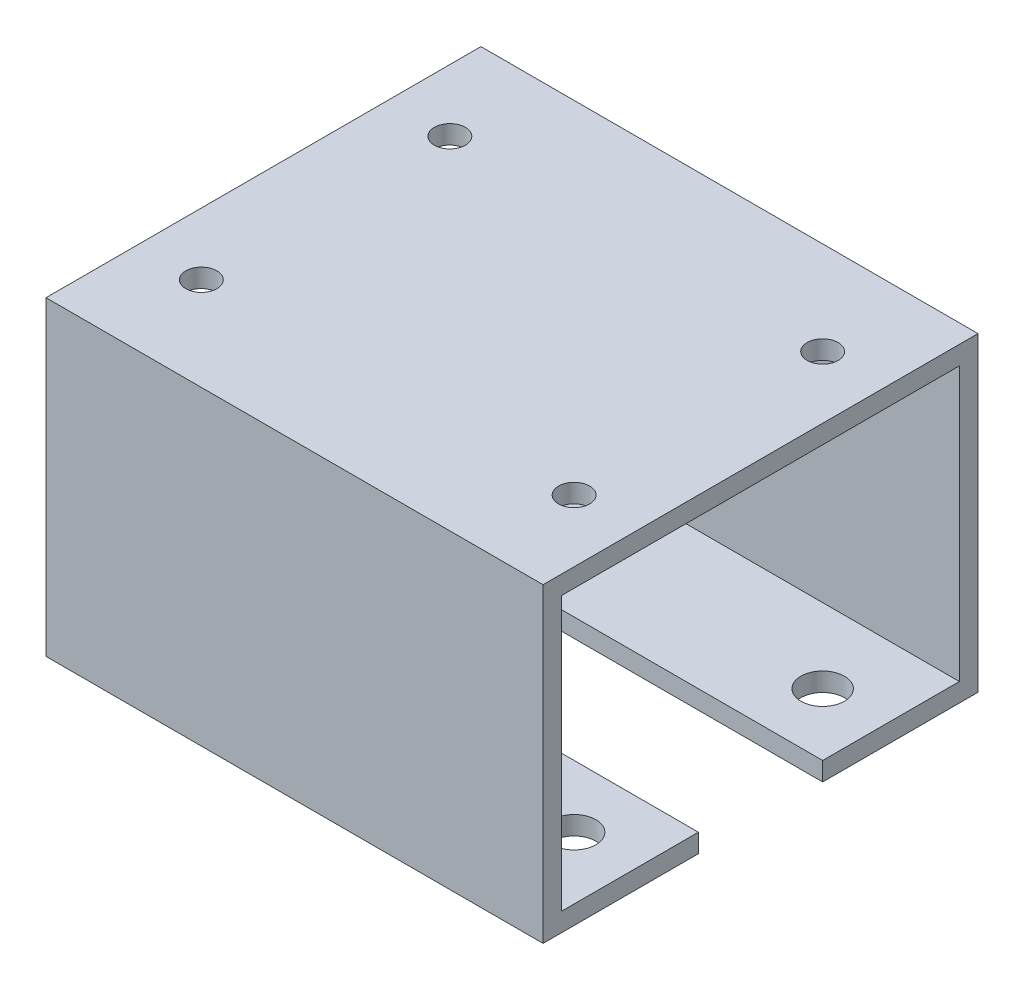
ISO-10303-21;
HEADER;
FILE_DESCRIPTION(('STEP AP214'),'2;1');
FILE_NAME('part.step','',(''),(''),'','','');
FILE_SCHEMA(('AUTOMOTIVE_DESIGN { 1 0 10303 214 1 1 1 1 }'));
ENDSEC;
DATA;
#1=APPLICATION_CONTEXT('core data for automotive mechanical design processes');
#2=APPLICATION_PROTOCOL_DEFINITION('international standard','automotive_design',2000,#1);
#3=PRODUCT_CONTEXT('',#1,'mechanical');
#4=PRODUCT('Part','Part','',(#3));
#5=PRODUCT_RELATED_PRODUCT_CATEGORY('part','',(#4));
#6=PRODUCT_DEFINITION_FORMATION('','',#4);
#7=PRODUCT_DEFINITION_CONTEXT('part definition',#1,'design');
#8=PRODUCT_DEFINITION('design','',#6,#7);
#9=PRODUCT_DEFINITION_SHAPE('','',#8);
#10=(LENGTH_UNIT() NAMED_UNIT(*) SI_UNIT(.MILLI.,.METRE.));
#11=(NAMED_UNIT(*) PLANE_ANGLE_UNIT() SI_UNIT($,.RADIAN.));
#12=(NAMED_UNIT(*) SI_UNIT($,.STERADIAN.) SOLID_ANGLE_UNIT());
#13=UNCERTAINTY_MEASURE_WITH_UNIT(LENGTH_MEASURE(1.E-05),#10,'distance_accuracy_value','');
#14=(GEOMETRIC_REPRESENTATION_CONTEXT(3) GLOBAL_UNCERTAINTY_ASSIGNED_CONTEXT((#13)) GLOBAL_UNIT_ASSIGNED_CONTEXT((#10,
#11,#12)) REPRESENTATION_CONTEXT('',''));
#15=CARTESIAN_POINT('',(0.,0.,0.));
#16=DIRECTION('',(0.,0.,1.));
#17=DIRECTION('',(1.,0.,0.));
#18=AXIS2_PLACEMENT_3D('',#15,#16,#17);
#19=CARTESIAN_POINT('',(-40.,156.301458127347,-35.));
#20=DIRECTION('',(1.,0.,0.));
#21=DIRECTION('',(0.,0.,-1.));
#22=AXIS2_PLACEMENT_3D('',#19,#20,#21);
#23=PLANE('',#22);
#24=DIRECTION('',(0.,-1.,0.));
#25=VECTOR('',#24,1.);
#26=CARTESIAN_POINT('',(-40.,50.001,10.));
#27=LINE('',#26,#25);
#28=CARTESIAN_POINT('',(-40.,3.,9.99999999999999));
#29=VERTEX_POINT('',#28);
#30=CARTESIAN_POINT('',(-40.,0.,10.));
#31=VERTEX_POINT('',#30);
#32=EDGE_CURVE('E55',#29,#31,#27,.T.);
#33=ORIENTED_EDGE('',*,*,#32,.T.);
#34=DIRECTION('',(0.,0.,1.));
#35=VECTOR('',#34,1.);
#36=CARTESIAN_POINT('',(-40.,0.,-35.));
#37=LINE('',#36,#35);
#38=CARTESIAN_POINT('',(-40.,0.,35.));
#39=VERTEX_POINT('',#38);
#40=EDGE_CURVE('E177',#31,#39,#37,.T.);
#41=ORIENTED_EDGE('',*,*,#40,.T.);
#42=DIRECTION('',(0.,-1.,0.));
#43=VECTOR('',#42,1.);
#44=CARTESIAN_POINT('',(-40.,156.301458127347,35.));
#45=LINE('',#44,#43);
#46=CARTESIAN_POINT('',(-40.,50.,35.));
#47=VERTEX_POINT('',#46);
#48=EDGE_CURVE('E176',#47,#39,#45,.T.);
#49=ORIENTED_EDGE('',*,*,#48,.F.);
#50=DIRECTION('',(0.,0.,1.));
#51=VECTOR('',#50,1.);
#52=CARTESIAN_POINT('',(-40.,50.,-35.));
#53=LINE('',#52,#51);
#54=CARTESIAN_POINT('',(-40.,50.,-35.));
#55=VERTEX_POINT('',#54);
#56=EDGE_CURVE('E181',#55,#47,#53,.T.);
#57=ORIENTED_EDGE('',*,*,#56,.F.);
#58=DIRECTION('',(0.,-1.,0.));
#59=VECTOR('',#58,1.);
#60=CARTESIAN_POINT('',(-40.,156.301458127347,-35.));
#61=LINE('',#60,#59);
#62=CARTESIAN_POINT('',(-40.,0.,-35.));
#63=VERTEX_POINT('',#62);
#64=EDGE_CURVE('E34',#55,#63,#61,.T.);
#65=ORIENTED_EDGE('',*,*,#64,.T.);
#66=CARTESIAN_POINT('',(-40.,0.,-10.));
#67=VERTEX_POINT('',#66);
#68=EDGE_CURVE('E134',#63,#67,#37,.T.);
#69=ORIENTED_EDGE('',*,*,#68,.T.);
#70=DIRECTION('',(0.,-1.,0.));
#71=VECTOR('',#70,1.);
#72=CARTESIAN_POINT('',(-40.,50.001,-10.));
#73=LINE('',#72,#71);
#74=CARTESIAN_POINT('',(-40.,3.,-10.));
#75=VERTEX_POINT('',#74);
#76=EDGE_CURVE('E121',#75,#67,#73,.T.);
#77=ORIENTED_EDGE('',*,*,#76,.F.);
#78=DIRECTION('',(0.,0.,1.));
#79=VECTOR('',#78,1.);
#80=CARTESIAN_POINT('',(-40.,3.,-35.));
#81=LINE('',#80,#79);
#82=CARTESIAN_POINT('',(-40.,3.,-32.));
#83=VERTEX_POINT('',#82);
#84=EDGE_CURVE('E132',#83,#75,#81,.T.);
#85=ORIENTED_EDGE('',*,*,#84,.F.);
#86=DIRECTION('',(0.,-1.,0.));
#87=VECTOR('',#86,1.);
#88=CARTESIAN_POINT('',(-40.,156.301458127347,-32.));
#89=LINE('',#88,#87);
#90=CARTESIAN_POINT('',(-40.,47.,-32.));
#91=VERTEX_POINT('',#90);
#92=EDGE_CURVE('E126',#91,#83,#89,.T.);
#93=ORIENTED_EDGE('',*,*,#92,.F.);
#94=DIRECTION('',(0.,0.,1.));
#95=VECTOR('',#94,1.);
#96=CARTESIAN_POINT('',(-40.,47.,-35.));
#97=LINE('',#96,#95);
#98=CARTESIAN_POINT('',(-40.,47.,32.));
#99=VERTEX_POINT('',#98);
#100=EDGE_CURVE('E210',#91,#99,#97,.T.);
#101=ORIENTED_EDGE('',*,*,#100,.T.);
#102=DIRECTION('',(0.,-1.,0.));
#103=VECTOR('',#102,1.);
#104=CARTESIAN_POINT('',(-40.,156.301458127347,32.));
#105=LINE('',#104,#103);
#106=CARTESIAN_POINT('',(-40.,3.,32.));
#107=VERTEX_POINT('',#106);
#108=EDGE_CURVE('E141',#99,#107,#105,.T.);
#109=ORIENTED_EDGE('',*,*,#108,.T.);
#110=EDGE_CURVE('E142',#29,#107,#81,.T.);
#111=ORIENTED_EDGE('',*,*,#110,.F.);
#112=EDGE_LOOP('',(#33,#41,#49,#57,#65,#69,#77,#85,#93,#101,#109,#111));
#113=FACE_BOUND('',#112,.T.);
#114=ADVANCED_FACE('F30',(#113),#23,.F.);
#115=CARTESIAN_POINT('',(40.,156.301458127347,-35.));
#116=DIRECTION('',(-1.,0.,0.));
#117=DIRECTION('',(0.,0.,1.));
#118=AXIS2_PLACEMENT_3D('',#115,#116,#117);
#119=PLANE('',#118);
#120=DIRECTION('',(0.,-1.,0.));
#121=VECTOR('',#120,1.);
#122=CARTESIAN_POINT('',(40.,50.001,9.99999999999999));
#123=LINE('',#122,#121);
#124=CARTESIAN_POINT('',(40.,3.,9.99999999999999));
#125=VERTEX_POINT('',#124);
#126=CARTESIAN_POINT('',(40.,0.,9.99999999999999));
#127=VERTEX_POINT('',#126);
#128=EDGE_CURVE('E205',#125,#127,#123,.T.);
#129=ORIENTED_EDGE('',*,*,#128,.F.);
#130=DIRECTION('',(0.,0.,-1.));
#131=VECTOR('',#130,1.);
#132=CARTESIAN_POINT('',(40.,3.,-35.));
#133=LINE('',#132,#131);
#134=CARTESIAN_POINT('',(40.,3.,32.));
#135=VERTEX_POINT('',#134);
#136=EDGE_CURVE('E153',#135,#125,#133,.T.);
#137=ORIENTED_EDGE('',*,*,#136,.F.);
#138=DIRECTION('',(0.,-1.,0.));
#139=VECTOR('',#138,1.);
#140=CARTESIAN_POINT('',(40.,156.301458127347,32.));
#141=LINE('',#140,#139);
#142=CARTESIAN_POINT('',(40.,47.,32.));
#143=VERTEX_POINT('',#142);
#144=EDGE_CURVE('E150',#143,#135,#141,.T.);
#145=ORIENTED_EDGE('',*,*,#144,.F.);
#146=DIRECTION('',(0.,0.,-1.));
#147=VECTOR('',#146,1.);
#148=CARTESIAN_POINT('',(40.,47.,-35.));
#149=LINE('',#148,#147);
#150=CARTESIAN_POINT('',(40.,47.,-32.));
#151=VERTEX_POINT('',#150);
#152=EDGE_CURVE('E159',#143,#151,#149,.T.);
#153=ORIENTED_EDGE('',*,*,#152,.T.);
#154=DIRECTION('',(0.,-1.,0.));
#155=VECTOR('',#154,1.);
#156=CARTESIAN_POINT('',(40.,156.301458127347,-32.));
#157=LINE('',#156,#155);
#158=CARTESIAN_POINT('',(40.,3.,-32.));
#159=VERTEX_POINT('',#158);
#160=EDGE_CURVE('E156',#151,#159,#157,.T.);
#161=ORIENTED_EDGE('',*,*,#160,.T.);
#162=CARTESIAN_POINT('',(40.,3.,-10.));
#163=VERTEX_POINT('',#162);
#164=EDGE_CURVE('E152',#163,#159,#133,.T.);
#165=ORIENTED_EDGE('',*,*,#164,.F.);
#166=DIRECTION('',(0.,-1.,0.));
#167=VECTOR('',#166,1.);
#168=CARTESIAN_POINT('',(40.,50.001,-10.));
#169=LINE('',#168,#167);
#170=CARTESIAN_POINT('',(40.,0.,-10.));
#171=VERTEX_POINT('',#170);
#172=EDGE_CURVE('E47',#163,#171,#169,.T.);
#173=ORIENTED_EDGE('',*,*,#172,.T.);
#174=DIRECTION('',(0.,0.,-1.));
#175=VECTOR('',#174,1.);
#176=CARTESIAN_POINT('',(40.,0.,-35.));
#177=LINE('',#176,#175);
#178=CARTESIAN_POINT('',(40.,0.,-35.));
#179=VERTEX_POINT('',#178);
#180=EDGE_CURVE('E171',#171,#179,#177,.T.);
#181=ORIENTED_EDGE('',*,*,#180,.T.);
#182=DIRECTION('',(0.,-1.,0.));
#183=VECTOR('',#182,1.);
#184=CARTESIAN_POINT('',(40.,156.301458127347,-35.));
#185=LINE('',#184,#183);
#186=CARTESIAN_POINT('',(40.,50.,-35.));
#187=VERTEX_POINT('',#186);
#188=EDGE_CURVE('E167',#187,#179,#185,.T.);
#189=ORIENTED_EDGE('',*,*,#188,.F.);
#190=DIRECTION('',(0.,0.,-1.));
#191=VECTOR('',#190,1.);
#192=CARTESIAN_POINT('',(40.,50.,-35.));
#193=LINE('',#192,#191);
#194=CARTESIAN_POINT('',(40.,50.,35.));
#195=VERTEX_POINT('',#194);
#196=EDGE_CURVE('E11',#195,#187,#193,.T.);
#197=ORIENTED_EDGE('',*,*,#196,.F.);
#198=DIRECTION('',(0.,-1.,0.));
#199=VECTOR('',#198,1.);
#200=CARTESIAN_POINT('',(40.,156.301458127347,35.));
#201=LINE('',#200,#199);
#202=CARTESIAN_POINT('',(40.,0.,35.));
#203=VERTEX_POINT('',#202);
#204=EDGE_CURVE('E175',#195,#203,#201,.T.);
#205=ORIENTED_EDGE('',*,*,#204,.T.);
#206=EDGE_CURVE('E168',#203,#127,#177,.T.);
#207=ORIENTED_EDGE('',*,*,#206,.T.);
#208=EDGE_LOOP('',(#129,#137,#145,#153,#161,#165,#173,#181,#189,#197,#205,#207));
#209=FACE_BOUND('',#208,.T.);
#210=ADVANCED_FACE('F225',(#209),#119,.F.);
#211=CARTESIAN_POINT('',(-40.,0.,35.));
#212=DIRECTION('',(0.,1.,0.));
#213=DIRECTION('',(0.,0.,1.));
#214=AXIS2_PLACEMENT_3D('',#211,#212,#213);
#215=PLANE('',#214);
#216=CARTESIAN_POINT('',(-30.,0.,20.));
#217=DIRECTION('',(0.,1.,0.));
#218=DIRECTION('',(0.,0.,1.));
#219=AXIS2_PLACEMENT_3D('',#216,#217,#218);
#220=CIRCLE('',#219,3.5);
#221=CARTESIAN_POINT('',(-30.,0.,23.5));
#222=VERTEX_POINT('',#221);
#223=EDGE_CURVE('E353',#222,#222,#220,.T.);
#224=ORIENTED_EDGE('',*,*,#223,.T.);
#225=EDGE_LOOP('',(#224));
#226=FACE_BOUND('',#225,.T.);
#227=CARTESIAN_POINT('',(30.,0.,20.));
#228=DIRECTION('',(0.,1.,0.));
#229=DIRECTION('',(0.,0.,1.));
#230=AXIS2_PLACEMENT_3D('',#227,#228,#229);
#231=CIRCLE('',#230,3.5);
#232=CARTESIAN_POINT('',(30.,0.,23.5));
#233=VERTEX_POINT('',#232);
#234=EDGE_CURVE('E359',#233,#233,#231,.T.);
#235=ORIENTED_EDGE('',*,*,#234,.T.);
#236=EDGE_LOOP('',(#235));
#237=FACE_BOUND('',#236,.T.);
#238=DIRECTION('',(1.,0.,0.));
#239=VECTOR('',#238,1.);
#240=CARTESIAN_POINT('',(-40.,0.,10.));
#241=LINE('',#240,#239);
#242=EDGE_CURVE('E197',#31,#127,#241,.T.);
#243=ORIENTED_EDGE('',*,*,#242,.T.);
#244=ORIENTED_EDGE('',*,*,#206,.F.);
#245=DIRECTION('',(1.,0.,0.));
#246=VECTOR('',#245,1.);
#247=CARTESIAN_POINT('',(-40.,0.,35.));
#248=LINE('',#247,#246);
#249=EDGE_CURVE('E172',#39,#203,#248,.T.);
#250=ORIENTED_EDGE('',*,*,#249,.F.);
#251=ORIENTED_EDGE('',*,*,#40,.F.);
#252=EDGE_LOOP('',(#243,#244,#250,#251));
#253=FACE_BOUND('',#252,.T.);
#254=ADVANCED_FACE('F237',(#226,#237,#253),#215,.F.);
#255=CARTESIAN_POINT('',(30.,0.,-20.));
#256=DIRECTION('',(0.,1.,0.));
#257=DIRECTION('',(0.,0.,1.));
#258=AXIS2_PLACEMENT_3D('',#255,#256,#257);
#259=CIRCLE('',#258,3.5);
#260=CARTESIAN_POINT('',(30.,0.,-16.5));
#261=VERTEX_POINT('',#260);
#262=EDGE_CURVE('E341',#261,#261,#259,.T.);
#263=ORIENTED_EDGE('',*,*,#262,.T.);
#264=EDGE_LOOP('',(#263));
#265=FACE_BOUND('',#264,.T.);
#266=CARTESIAN_POINT('',(-30.,0.,-20.));
#267=DIRECTION('',(0.,1.,0.));
#268=DIRECTION('',(0.,0.,1.));
#269=AXIS2_PLACEMENT_3D('',#266,#267,#268);
#270=CIRCLE('',#269,3.5);
#271=CARTESIAN_POINT('',(-30.,0.,-16.5));
#272=VERTEX_POINT('',#271);
#273=EDGE_CURVE('E347',#272,#272,#270,.T.);
#274=ORIENTED_EDGE('',*,*,#273,.T.);
#275=EDGE_LOOP('',(#274));
#276=FACE_BOUND('',#275,.T.);
#277=DIRECTION('',(-1.,0.,0.));
#278=VECTOR('',#277,1.);
#279=CARTESIAN_POINT('',(-40.,0.,-10.));
#280=LINE('',#279,#278);
#281=EDGE_CURVE('E135',#171,#67,#280,.T.);
#282=ORIENTED_EDGE('',*,*,#281,.T.);
#283=ORIENTED_EDGE('',*,*,#68,.F.);
#284=DIRECTION('',(-1.,0.,0.));
#285=VECTOR('',#284,1.);
#286=CARTESIAN_POINT('',(-40.,0.,-35.));
#287=LINE('',#286,#285);
#288=EDGE_CURVE('E163',#179,#63,#287,.T.);
#289=ORIENTED_EDGE('',*,*,#288,.F.);
#290=ORIENTED_EDGE('',*,*,#180,.F.);
#291=EDGE_LOOP('',(#282,#283,#289,#290));
#292=FACE_BOUND('',#291,.T.);
#293=ADVANCED_FACE('F196',(#265,#276,#292),#215,.F.);
#294=CARTESIAN_POINT('',(-40.,3.,35.));
#295=DIRECTION('',(0.,1.,0.));
#296=DIRECTION('',(0.,0.,1.));
#297=AXIS2_PLACEMENT_3D('',#294,#295,#296);
#298=PLANE('',#297);
#299=CARTESIAN_POINT('',(-30.,3.,20.));
#300=DIRECTION('',(0.,1.,0.));
#301=DIRECTION('',(0.,0.,1.));
#302=AXIS2_PLACEMENT_3D('',#299,#300,#301);
#303=CIRCLE('',#302,3.5);
#304=CARTESIAN_POINT('',(-30.,3.,23.5));
#305=VERTEX_POINT('',#304);
#306=EDGE_CURVE('E350',#305,#305,#303,.T.);
#307=ORIENTED_EDGE('',*,*,#306,.F.);
#308=EDGE_LOOP('',(#307));
#309=FACE_BOUND('',#308,.T.);
#310=CARTESIAN_POINT('',(30.,3.,20.));
#311=DIRECTION('',(0.,1.,0.));
#312=DIRECTION('',(0.,0.,1.));
#313=AXIS2_PLACEMENT_3D('',#310,#311,#312);
#314=CIRCLE('',#313,3.5);
#315=CARTESIAN_POINT('',(30.,3.,23.5));
#316=VERTEX_POINT('',#315);
#317=EDGE_CURVE('E356',#316,#316,#314,.T.);
#318=ORIENTED_EDGE('',*,*,#317,.F.);
#319=EDGE_LOOP('',(#318));
#320=FACE_BOUND('',#319,.T.);
#321=ORIENTED_EDGE('',*,*,#136,.T.);
#322=DIRECTION('',(1.,0.,0.));
#323=VECTOR('',#322,1.);
#324=CARTESIAN_POINT('',(-40.,3.,10.));
#325=LINE('',#324,#323);
#326=EDGE_CURVE('E200',#29,#125,#325,.T.);
#327=ORIENTED_EDGE('',*,*,#326,.F.);
#328=ORIENTED_EDGE('',*,*,#110,.T.);
#329=DIRECTION('',(1.,0.,0.));
#330=VECTOR('',#329,1.);
#331=CARTESIAN_POINT('',(-40.,3.,32.));
#332=LINE('',#331,#330);
#333=EDGE_CURVE('E145',#107,#135,#332,.T.);
#334=ORIENTED_EDGE('',*,*,#333,.T.);
#335=EDGE_LOOP('',(#321,#327,#328,#334));
#336=FACE_BOUND('',#335,.T.);
#337=ADVANCED_FACE('F232',(#309,#320,#336),#298,.T.);
#338=CARTESIAN_POINT('',(30.,3.,-20.));
#339=DIRECTION('',(0.,1.,0.));
#340=DIRECTION('',(0.,0.,1.));
#341=AXIS2_PLACEMENT_3D('',#338,#339,#340);
#342=CIRCLE('',#341,3.5);
#343=CARTESIAN_POINT('',(30.,3.,-16.5));
#344=VERTEX_POINT('',#343);
#345=EDGE_CURVE('E340',#344,#344,#342,.T.);
#346=ORIENTED_EDGE('',*,*,#345,.F.);
#347=EDGE_LOOP('',(#346));
#348=FACE_BOUND('',#347,.T.);
#349=CARTESIAN_POINT('',(-30.,3.,-20.));
#350=DIRECTION('',(0.,1.,0.));
#351=DIRECTION('',(0.,0.,1.));
#352=AXIS2_PLACEMENT_3D('',#349,#350,#351);
#353=CIRCLE('',#352,3.5);
#354=CARTESIAN_POINT('',(-30.,3.,-16.5));
#355=VERTEX_POINT('',#354);
#356=EDGE_CURVE('E344',#355,#355,#353,.T.);
#357=ORIENTED_EDGE('',*,*,#356,.F.);
#358=EDGE_LOOP('',(#357));
#359=FACE_BOUND('',#358,.T.);
#360=ORIENTED_EDGE('',*,*,#84,.T.);
#361=DIRECTION('',(-1.,0.,0.));
#362=VECTOR('',#361,1.);
#363=CARTESIAN_POINT('',(-40.,3.,-10.));
#364=LINE('',#363,#362);
#365=EDGE_CURVE('E118',#163,#75,#364,.T.);
#366=ORIENTED_EDGE('',*,*,#365,.F.);
#367=ORIENTED_EDGE('',*,*,#164,.T.);
#368=DIRECTION('',(-1.,0.,0.));
#369=VECTOR('',#368,1.);
#370=CARTESIAN_POINT('',(-40.,3.,-32.));
#371=LINE('',#370,#369);
#372=EDGE_CURVE('E140',#159,#83,#371,.T.);
#373=ORIENTED_EDGE('',*,*,#372,.T.);
#374=EDGE_LOOP('',(#360,#366,#367,#373));
#375=FACE_BOUND('',#374,.T.);
#376=ADVANCED_FACE('F138',(#348,#359,#375),#298,.T.);
#377=CARTESIAN_POINT('',(-40.,156.301458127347,35.));
#378=DIRECTION('',(0.,0.,-1.));
#379=DIRECTION('',(-1.,0.,0.));
#380=AXIS2_PLACEMENT_3D('',#377,#378,#379);
#381=PLANE('',#380);
#382=DIRECTION('',(1.,0.,0.));
#383=VECTOR('',#382,1.);
#384=CARTESIAN_POINT('',(-40.,50.,35.));
#385=LINE('',#384,#383);
#386=EDGE_CURVE('E39',#47,#195,#385,.T.);
#387=ORIENTED_EDGE('',*,*,#386,.F.);
#388=ORIENTED_EDGE('',*,*,#48,.T.);
#389=ORIENTED_EDGE('',*,*,#249,.T.);
#390=ORIENTED_EDGE('',*,*,#204,.F.);
#391=EDGE_LOOP('',(#387,#388,#389,#390));
#392=FACE_BOUND('',#391,.T.);
#393=ADVANCED_FACE('F244',(#392),#381,.F.);
#394=CARTESIAN_POINT('',(-40.,156.301458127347,-35.));
#395=DIRECTION('',(0.,0.,1.));
#396=DIRECTION('',(1.,0.,0.));
#397=AXIS2_PLACEMENT_3D('',#394,#395,#396);
#398=PLANE('',#397);
#399=DIRECTION('',(-1.,0.,0.));
#400=VECTOR('',#399,1.);
#401=CARTESIAN_POINT('',(-40.,50.,-35.));
#402=LINE('',#401,#400);
#403=EDGE_CURVE('E166',#187,#55,#402,.T.);
#404=ORIENTED_EDGE('',*,*,#403,.F.);
#405=ORIENTED_EDGE('',*,*,#188,.T.);
#406=ORIENTED_EDGE('',*,*,#288,.T.);
#407=ORIENTED_EDGE('',*,*,#64,.F.);
#408=EDGE_LOOP('',(#404,#405,#406,#407));
#409=FACE_BOUND('',#408,.T.);
#410=ADVANCED_FACE('F192',(#409),#398,.F.);
#411=CARTESIAN_POINT('',(0.,50.,0.));
#412=DIRECTION('',(0.,1.,0.));
#413=DIRECTION('',(0.,0.,1.));
#414=AXIS2_PLACEMENT_3D('',#411,#412,#413);
#415=PLANE('',#414);
#416=CARTESIAN_POINT('',(-30.,50.,-20.));
#417=DIRECTION('',(0.,1.,0.));
#418=DIRECTION('',(0.,0.,1.));
#419=AXIS2_PLACEMENT_3D('',#416,#417,#418);
#420=CIRCLE('',#419,2.49999999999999);
#421=CARTESIAN_POINT('',(-30.,50.,-17.5));
#422=VERTEX_POINT('',#421);
#423=EDGE_CURVE('E317',#422,#422,#420,.T.);
#424=ORIENTED_EDGE('',*,*,#423,.F.);
#425=EDGE_LOOP('',(#424));
#426=FACE_BOUND('',#425,.T.);
#427=CARTESIAN_POINT('',(-30.,50.,20.));
#428=DIRECTION('',(0.,1.,0.));
#429=DIRECTION('',(0.,0.,1.));
#430=AXIS2_PLACEMENT_3D('',#427,#428,#429);
#431=CIRCLE('',#430,2.49999999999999);
#432=CARTESIAN_POINT('',(-30.,50.,22.5));
#433=VERTEX_POINT('',#432);
#434=EDGE_CURVE('E320',#433,#433,#431,.T.);
#435=ORIENTED_EDGE('',*,*,#434,.F.);
#436=EDGE_LOOP('',(#435));
#437=FACE_BOUND('',#436,.T.);
#438=CARTESIAN_POINT('',(30.,50.,20.));
#439=DIRECTION('',(0.,1.,0.));
#440=DIRECTION('',(0.,0.,1.));
#441=AXIS2_PLACEMENT_3D('',#438,#439,#440);
#442=CIRCLE('',#441,2.49999999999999);
#443=CARTESIAN_POINT('',(30.,50.,22.5));
#444=VERTEX_POINT('',#443);
#445=EDGE_CURVE('E328',#444,#444,#442,.T.);
#446=ORIENTED_EDGE('',*,*,#445,.F.);
#447=EDGE_LOOP('',(#446));
#448=FACE_BOUND('',#447,.T.);
#449=CARTESIAN_POINT('',(30.,50.,-20.));
#450=DIRECTION('',(0.,1.,0.));
#451=DIRECTION('',(0.,0.,1.));
#452=AXIS2_PLACEMENT_3D('',#449,#450,#451);
#453=CIRCLE('',#452,2.49999999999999);
#454=CARTESIAN_POINT('',(30.,50.,-17.5));
#455=VERTEX_POINT('',#454);
#456=EDGE_CURVE('E334',#455,#455,#453,.T.);
#457=ORIENTED_EDGE('',*,*,#456,.F.);
#458=EDGE_LOOP('',(#457));
#459=FACE_BOUND('',#458,.T.);
#460=ORIENTED_EDGE('',*,*,#403,.T.);
#461=ORIENTED_EDGE('',*,*,#56,.T.);
#462=ORIENTED_EDGE('',*,*,#386,.T.);
#463=ORIENTED_EDGE('',*,*,#196,.T.);
#464=EDGE_LOOP('',(#460,#461,#462,#463));
#465=FACE_BOUND('',#464,.T.);
#466=ADVANCED_FACE('F32',(#426,#437,#448,#459,#465),#415,.T.);
#467=CARTESIAN_POINT('',(-40.,156.301458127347,32.));
#468=DIRECTION('',(0.,0.,-1.));
#469=DIRECTION('',(-1.,0.,0.));
#470=AXIS2_PLACEMENT_3D('',#467,#468,#469);
#471=PLANE('',#470);
#472=DIRECTION('',(1.,0.,0.));
#473=VECTOR('',#472,1.);
#474=CARTESIAN_POINT('',(-40.,47.,32.));
#475=LINE('',#474,#473);
#476=EDGE_CURVE('E162',#99,#143,#475,.T.);
#477=ORIENTED_EDGE('',*,*,#476,.T.);
#478=ORIENTED_EDGE('',*,*,#144,.T.);
#479=ORIENTED_EDGE('',*,*,#333,.F.);
#480=ORIENTED_EDGE('',*,*,#108,.F.);
#481=EDGE_LOOP('',(#477,#478,#479,#480));
#482=FACE_BOUND('',#481,.T.);
#483=ADVANCED_FACE('F229',(#482),#471,.T.);
#484=CARTESIAN_POINT('',(-40.,156.301458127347,-32.));
#485=DIRECTION('',(0.,0.,1.));
#486=DIRECTION('',(1.,0.,0.));
#487=AXIS2_PLACEMENT_3D('',#484,#485,#486);
#488=PLANE('',#487);
#489=DIRECTION('',(-1.,0.,0.));
#490=VECTOR('',#489,1.);
#491=CARTESIAN_POINT('',(-40.,47.,-32.));
#492=LINE('',#491,#490);
#493=EDGE_CURVE('E214',#151,#91,#492,.T.);
#494=ORIENTED_EDGE('',*,*,#493,.T.);
#495=ORIENTED_EDGE('',*,*,#92,.T.);
#496=ORIENTED_EDGE('',*,*,#372,.F.);
#497=ORIENTED_EDGE('',*,*,#160,.F.);
#498=EDGE_LOOP('',(#494,#495,#496,#497));
#499=FACE_BOUND('',#498,.T.);
#500=ADVANCED_FACE('F223',(#499),#488,.T.);
#501=CARTESIAN_POINT('',(0.,47.,0.));
#502=DIRECTION('',(0.,1.,0.));
#503=DIRECTION('',(0.,0.,1.));
#504=AXIS2_PLACEMENT_3D('',#501,#502,#503);
#505=PLANE('',#504);
#506=CARTESIAN_POINT('',(-30.,47.,-20.));
#507=DIRECTION('',(0.,1.,0.));
#508=DIRECTION('',(0.,0.,1.));
#509=AXIS2_PLACEMENT_3D('',#506,#507,#508);
#510=CIRCLE('',#509,2.49999999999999);
#511=CARTESIAN_POINT('',(-30.,47.,-17.5));
#512=VERTEX_POINT('',#511);
#513=EDGE_CURVE('E314',#512,#512,#510,.T.);
#514=ORIENTED_EDGE('',*,*,#513,.T.);
#515=EDGE_LOOP('',(#514));
#516=FACE_BOUND('',#515,.T.);
#517=CARTESIAN_POINT('',(-30.,47.,20.));
#518=DIRECTION('',(0.,1.,0.));
#519=DIRECTION('',(0.,0.,1.));
#520=AXIS2_PLACEMENT_3D('',#517,#518,#519);
#521=CIRCLE('',#520,2.49999999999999);
#522=CARTESIAN_POINT('',(-30.,47.,22.5));
#523=VERTEX_POINT('',#522);
#524=EDGE_CURVE('E325',#523,#523,#521,.T.);
#525=ORIENTED_EDGE('',*,*,#524,.T.);
#526=EDGE_LOOP('',(#525));
#527=FACE_BOUND('',#526,.T.);
#528=CARTESIAN_POINT('',(30.,47.,20.));
#529=DIRECTION('',(0.,1.,0.));
#530=DIRECTION('',(0.,0.,1.));
#531=AXIS2_PLACEMENT_3D('',#528,#529,#530);
#532=CIRCLE('',#531,2.5);
#533=CARTESIAN_POINT('',(30.,47.,22.5));
#534=VERTEX_POINT('',#533);
#535=EDGE_CURVE('E331',#534,#534,#532,.T.);
#536=ORIENTED_EDGE('',*,*,#535,.T.);
#537=EDGE_LOOP('',(#536));
#538=FACE_BOUND('',#537,.T.);
#539=CARTESIAN_POINT('',(30.,47.,-20.));
#540=DIRECTION('',(0.,1.,0.));
#541=DIRECTION('',(0.,0.,1.));
#542=AXIS2_PLACEMENT_3D('',#539,#540,#541);
#543=CIRCLE('',#542,2.5);
#544=CARTESIAN_POINT('',(30.,47.,-17.5));
#545=VERTEX_POINT('',#544);
#546=EDGE_CURVE('E337',#545,#545,#543,.T.);
#547=ORIENTED_EDGE('',*,*,#546,.T.);
#548=EDGE_LOOP('',(#547));
#549=FACE_BOUND('',#548,.T.);
#550=ORIENTED_EDGE('',*,*,#493,.F.);
#551=ORIENTED_EDGE('',*,*,#152,.F.);
#552=ORIENTED_EDGE('',*,*,#476,.F.);
#553=ORIENTED_EDGE('',*,*,#100,.F.);
#554=EDGE_LOOP('',(#550,#551,#552,#553));
#555=FACE_BOUND('',#554,.T.);
#556=ADVANCED_FACE('F221',(#516,#527,#538,#549,#555),#505,.F.);
#557=CARTESIAN_POINT('',(-40.,50.001,-10.));
#558=DIRECTION('',(0.,0.,1.));
#559=DIRECTION('',(1.,0.,0.));
#560=AXIS2_PLACEMENT_3D('',#557,#558,#559);
#561=PLANE('',#560);
#562=ORIENTED_EDGE('',*,*,#365,.T.);
#563=ORIENTED_EDGE('',*,*,#76,.T.);
#564=ORIENTED_EDGE('',*,*,#281,.F.);
#565=ORIENTED_EDGE('',*,*,#172,.F.);
#566=EDGE_LOOP('',(#562,#563,#564,#565));
#567=FACE_BOUND('',#566,.T.);
#568=ADVANCED_FACE('F120',(#567),#561,.T.);
#569=CARTESIAN_POINT('',(-40.,50.001,10.));
#570=DIRECTION('',(0.,0.,-1.));
#571=DIRECTION('',(-1.,0.,0.));
#572=AXIS2_PLACEMENT_3D('',#569,#570,#571);
#573=PLANE('',#572);
#574=ORIENTED_EDGE('',*,*,#326,.T.);
#575=ORIENTED_EDGE('',*,*,#128,.T.);
#576=ORIENTED_EDGE('',*,*,#242,.F.);
#577=ORIENTED_EDGE('',*,*,#32,.F.);
#578=EDGE_LOOP('',(#574,#575,#576,#577));
#579=FACE_BOUND('',#578,.T.);
#580=ADVANCED_FACE('F234',(#579),#573,.T.);
#581=CARTESIAN_POINT('',(30.,0.,20.));
#582=DIRECTION('',(0.,1.,0.));
#583=DIRECTION('',(0.,0.,1.));
#584=AXIS2_PLACEMENT_3D('',#581,#582,#583);
#585=CYLINDRICAL_SURFACE('',#584,3.5);
#586=ORIENTED_EDGE('',*,*,#234,.F.);
#587=EDGE_LOOP('',(#586));
#588=FACE_BOUND('',#587,.T.);
#589=ORIENTED_EDGE('',*,*,#317,.T.);
#590=EDGE_LOOP('',(#589));
#591=FACE_BOUND('',#590,.T.);
#592=ADVANCED_FACE('F276',(#588,#591),#585,.F.);
#593=CARTESIAN_POINT('',(-30.,0.,20.));
#594=DIRECTION('',(0.,1.,0.));
#595=DIRECTION('',(0.,0.,1.));
#596=AXIS2_PLACEMENT_3D('',#593,#594,#595);
#597=CYLINDRICAL_SURFACE('',#596,3.5);
#598=ORIENTED_EDGE('',*,*,#223,.F.);
#599=EDGE_LOOP('',(#598));
#600=FACE_BOUND('',#599,.T.);
#601=ORIENTED_EDGE('',*,*,#306,.T.);
#602=EDGE_LOOP('',(#601));
#603=FACE_BOUND('',#602,.T.);
#604=ADVANCED_FACE('F281',(#600,#603),#597,.F.);
#605=CARTESIAN_POINT('',(-30.,0.,-20.));
#606=DIRECTION('',(0.,1.,0.));
#607=DIRECTION('',(0.,0.,1.));
#608=AXIS2_PLACEMENT_3D('',#605,#606,#607);
#609=CYLINDRICAL_SURFACE('',#608,3.5);
#610=ORIENTED_EDGE('',*,*,#273,.F.);
#611=EDGE_LOOP('',(#610));
#612=FACE_BOUND('',#611,.T.);
#613=ORIENTED_EDGE('',*,*,#356,.T.);
#614=EDGE_LOOP('',(#613));
#615=FACE_BOUND('',#614,.T.);
#616=ADVANCED_FACE('F285',(#612,#615),#609,.F.);
#617=CARTESIAN_POINT('',(30.,0.,-20.));
#618=DIRECTION('',(0.,1.,0.));
#619=DIRECTION('',(0.,0.,1.));
#620=AXIS2_PLACEMENT_3D('',#617,#618,#619);
#621=CYLINDRICAL_SURFACE('',#620,3.5);
#622=ORIENTED_EDGE('',*,*,#262,.F.);
#623=EDGE_LOOP('',(#622));
#624=FACE_BOUND('',#623,.T.);
#625=ORIENTED_EDGE('',*,*,#345,.T.);
#626=EDGE_LOOP('',(#625));
#627=FACE_BOUND('',#626,.T.);
#628=ADVANCED_FACE('F289',(#624,#627),#621,.F.);
#629=CARTESIAN_POINT('',(30.,50.,-20.));
#630=DIRECTION('',(0.,1.,0.));
#631=DIRECTION('',(0.,0.,1.));
#632=AXIS2_PLACEMENT_3D('',#629,#630,#631);
#633=CYLINDRICAL_SURFACE('',#632,2.5);
#634=ORIENTED_EDGE('',*,*,#546,.F.);
#635=EDGE_LOOP('',(#634));
#636=FACE_BOUND('',#635,.T.);
#637=ORIENTED_EDGE('',*,*,#456,.T.);
#638=EDGE_LOOP('',(#637));
#639=FACE_BOUND('',#638,.T.);
#640=ADVANCED_FACE('F293',(#636,#639),#633,.F.);
#641=CARTESIAN_POINT('',(30.,50.,20.));
#642=DIRECTION('',(0.,1.,0.));
#643=DIRECTION('',(0.,0.,1.));
#644=AXIS2_PLACEMENT_3D('',#641,#642,#643);
#645=CYLINDRICAL_SURFACE('',#644,2.5);
#646=ORIENTED_EDGE('',*,*,#535,.F.);
#647=EDGE_LOOP('',(#646));
#648=FACE_BOUND('',#647,.T.);
#649=ORIENTED_EDGE('',*,*,#445,.T.);
#650=EDGE_LOOP('',(#649));
#651=FACE_BOUND('',#650,.T.);
#652=ADVANCED_FACE('F297',(#648,#651),#645,.F.);
#653=CARTESIAN_POINT('',(-30.,50.,20.));
#654=DIRECTION('',(0.,1.,0.));
#655=DIRECTION('',(0.,0.,1.));
#656=AXIS2_PLACEMENT_3D('',#653,#654,#655);
#657=CYLINDRICAL_SURFACE('',#656,2.49999999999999);
#658=ORIENTED_EDGE('',*,*,#524,.F.);
#659=EDGE_LOOP('',(#658));
#660=FACE_BOUND('',#659,.T.);
#661=ORIENTED_EDGE('',*,*,#434,.T.);
#662=EDGE_LOOP('',(#661));
#663=FACE_BOUND('',#662,.T.);
#664=ADVANCED_FACE('F301',(#660,#663),#657,.F.);
#665=CARTESIAN_POINT('',(-30.,50.,-20.));
#666=DIRECTION('',(0.,1.,0.));
#667=DIRECTION('',(0.,0.,1.));
#668=AXIS2_PLACEMENT_3D('',#665,#666,#667);
#669=CYLINDRICAL_SURFACE('',#668,2.49999999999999);
#670=ORIENTED_EDGE('',*,*,#513,.F.);
#671=EDGE_LOOP('',(#670));
#672=FACE_BOUND('',#671,.T.);
#673=ORIENTED_EDGE('',*,*,#423,.T.);
#674=EDGE_LOOP('',(#673));
#675=FACE_BOUND('',#674,.T.);
#676=ADVANCED_FACE('F305',(#672,#675),#669,.F.);
#677=CLOSED_SHELL('',(#114,#210,#254,#293,#337,#376,#393,#410,#466,#483,#500,#556,#568,#580,
#592,#604,#616,#628,#640,#652,#664,#676));
#678=MANIFOLD_SOLID_BREP('B2',#677);
#679=ADVANCED_BREP_SHAPE_REPRESENTATION('',(#18,#678),#14);
#680=SHAPE_DEFINITION_REPRESENTATION(#9,#679);
ENDSEC;
END-ISO-10303-21;
